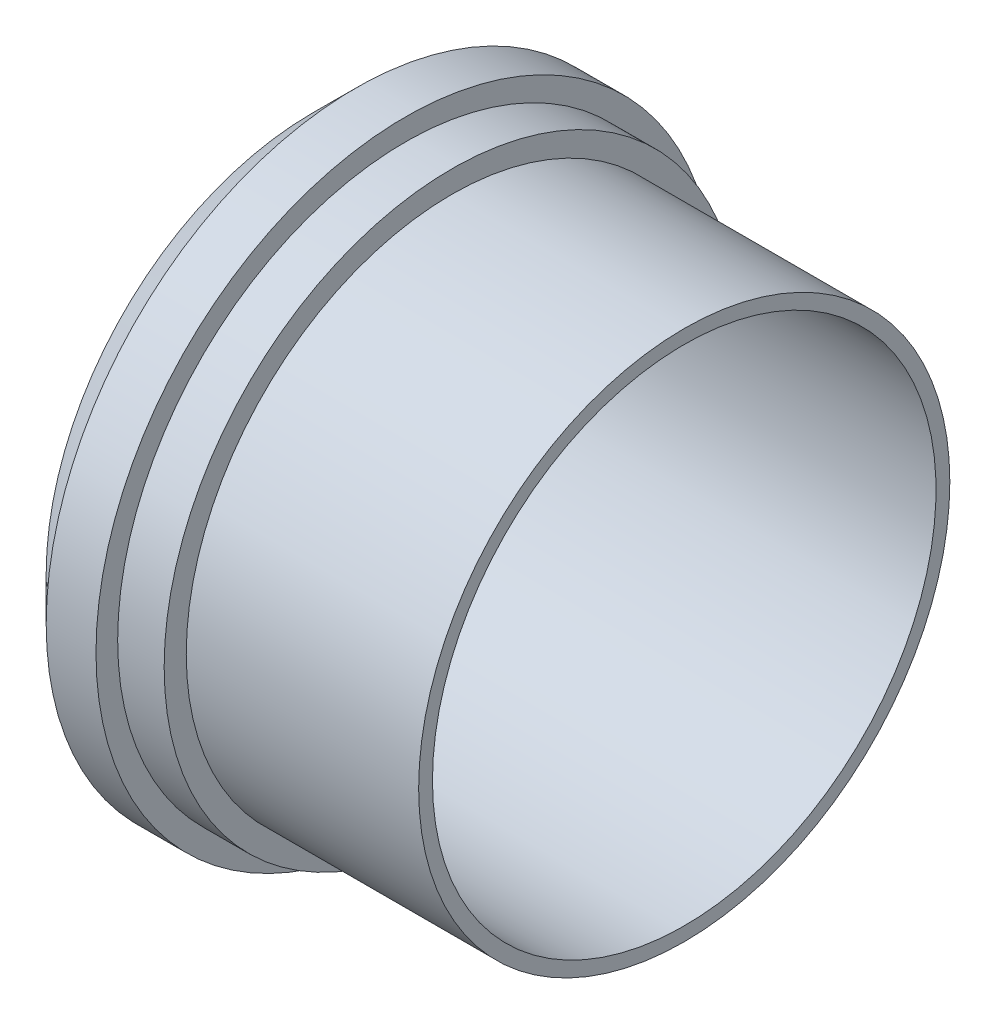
ISO-10303-21;
HEADER;
FILE_DESCRIPTION(('STEP AP214'),'2;1');
FILE_NAME('part.step','',(''),(''),'','','');
FILE_SCHEMA(('AUTOMOTIVE_DESIGN { 1 0 10303 214 1 1 1 1 }'));
ENDSEC;
DATA;
#1=APPLICATION_CONTEXT('core data for automotive mechanical design processes');
#2=APPLICATION_PROTOCOL_DEFINITION('international standard','automotive_design',2000,#1);
#3=PRODUCT_CONTEXT('',#1,'mechanical');
#4=PRODUCT('Part','Part','',(#3));
#5=PRODUCT_RELATED_PRODUCT_CATEGORY('part','',(#4));
#6=PRODUCT_DEFINITION_FORMATION('','',#4);
#7=PRODUCT_DEFINITION_CONTEXT('part definition',#1,'design');
#8=PRODUCT_DEFINITION('design','',#6,#7);
#9=PRODUCT_DEFINITION_SHAPE('','',#8);
#10=(LENGTH_UNIT() NAMED_UNIT(*) SI_UNIT(.MILLI.,.METRE.));
#11=(NAMED_UNIT(*) PLANE_ANGLE_UNIT() SI_UNIT($,.RADIAN.));
#12=(NAMED_UNIT(*) SI_UNIT($,.STERADIAN.) SOLID_ANGLE_UNIT());
#13=UNCERTAINTY_MEASURE_WITH_UNIT(LENGTH_MEASURE(1.E-05),#10,'distance_accuracy_value','');
#14=(GEOMETRIC_REPRESENTATION_CONTEXT(3) GLOBAL_UNCERTAINTY_ASSIGNED_CONTEXT((#13)) GLOBAL_UNIT_ASSIGNED_CONTEXT((#10,
#11,#12)) REPRESENTATION_CONTEXT('',''));
#15=CARTESIAN_POINT('',(0.,0.,0.));
#16=DIRECTION('',(0.,0.,1.));
#17=DIRECTION('',(1.,0.,0.));
#18=AXIS2_PLACEMENT_3D('',#15,#16,#17);
#19=CARTESIAN_POINT('',(0.,31.75,0.));
#20=DIRECTION('',(1.,0.,0.));
#21=DIRECTION('',(0.,0.,-1.));
#22=AXIS2_PLACEMENT_3D('',#19,#20,#21);
#23=PLANE('',#22);
#24=CARTESIAN_POINT('',(0.,31.75,0.));
#25=DIRECTION('',(-1.,0.,0.));
#26=DIRECTION('',(0.,0.,1.));
#27=AXIS2_PLACEMENT_3D('',#24,#25,#26);
#28=CIRCLE('',#27,30.099);
#29=CARTESIAN_POINT('',(0.,31.75,30.099));
#30=VERTEX_POINT('',#29);
#31=EDGE_CURVE('E59',#30,#30,#28,.T.);
#32=ORIENTED_EDGE('',*,*,#31,.T.);
#33=EDGE_LOOP('',(#32));
#34=FACE_BOUND('',#33,.T.);
#35=CARTESIAN_POINT('',(0.,31.75,0.));
#36=DIRECTION('',(-1.,0.,0.));
#37=DIRECTION('',(0.,0.,1.));
#38=AXIS2_PLACEMENT_3D('',#35,#36,#37);
#39=CIRCLE('',#38,31.75);
#40=CARTESIAN_POINT('',(0.,31.75,31.75));
#41=VERTEX_POINT('',#40);
#42=EDGE_CURVE('E10',#41,#41,#39,.T.);
#43=ORIENTED_EDGE('',*,*,#42,.F.);
#44=EDGE_LOOP('',(#43));
#45=FACE_BOUND('',#44,.T.);
#46=ADVANCED_FACE('F31',(#34,#45),#23,.T.);
#47=CARTESIAN_POINT('',(-44.45,31.75,0.));
#48=DIRECTION('',(-1.,0.,0.));
#49=DIRECTION('',(0.,0.,1.));
#50=AXIS2_PLACEMENT_3D('',#47,#48,#49);
#51=CYLINDRICAL_SURFACE('',#50,31.75);
#52=ORIENTED_EDGE('',*,*,#42,.T.);
#53=EDGE_LOOP('',(#52));
#54=FACE_BOUND('',#53,.T.);
#55=CARTESIAN_POINT('',(-27.77998,31.75,0.));
#56=DIRECTION('',(-1.,0.,0.));
#57=DIRECTION('',(0.,0.,1.));
#58=AXIS2_PLACEMENT_3D('',#55,#56,#57);
#59=CIRCLE('',#58,31.75);
#60=CARTESIAN_POINT('',(-27.77998,31.75,31.75));
#61=VERTEX_POINT('',#60);
#62=EDGE_CURVE('E37',#61,#61,#59,.T.);
#63=ORIENTED_EDGE('',*,*,#62,.F.);
#64=EDGE_LOOP('',(#63));
#65=FACE_BOUND('',#64,.T.);
#66=ADVANCED_FACE('F92',(#54,#65),#51,.T.);
#67=CARTESIAN_POINT('',(-27.77998,0.,0.));
#68=DIRECTION('',(1.,0.,0.));
#69=DIRECTION('',(0.,0.,-1.));
#70=AXIS2_PLACEMENT_3D('',#67,#68,#69);
#71=PLANE('',#70);
#72=ORIENTED_EDGE('',*,*,#62,.T.);
#73=EDGE_LOOP('',(#72));
#74=FACE_BOUND('',#73,.T.);
#75=CARTESIAN_POINT('',(-27.77998,31.75,0.));
#76=DIRECTION('',(-1.,0.,0.));
#77=DIRECTION('',(0.,0.,1.));
#78=AXIS2_PLACEMENT_3D('',#75,#76,#77);
#79=CIRCLE('',#78,34.3916);
#80=CARTESIAN_POINT('',(-27.77998,31.75,34.3916));
#81=VERTEX_POINT('',#80);
#82=EDGE_CURVE('E41',#81,#81,#79,.T.);
#83=ORIENTED_EDGE('',*,*,#82,.F.);
#84=EDGE_LOOP('',(#83));
#85=FACE_BOUND('',#84,.T.);
#86=ADVANCED_FACE('F96',(#74,#85),#71,.T.);
#87=CARTESIAN_POINT('',(-44.45,31.75,0.));
#88=DIRECTION('',(-1.,0.,0.));
#89=DIRECTION('',(0.,0.,1.));
#90=AXIS2_PLACEMENT_3D('',#87,#88,#89);
#91=CYLINDRICAL_SURFACE('',#90,34.3916);
#92=ORIENTED_EDGE('',*,*,#82,.T.);
#93=EDGE_LOOP('',(#92));
#94=FACE_BOUND('',#93,.T.);
#95=CARTESIAN_POINT('',(-33.3375,31.75,0.));
#96=DIRECTION('',(-1.,0.,0.));
#97=DIRECTION('',(0.,0.,1.));
#98=AXIS2_PLACEMENT_3D('',#95,#96,#97);
#99=CIRCLE('',#98,34.3916);
#100=CARTESIAN_POINT('',(-33.3375,31.75,34.3916));
#101=VERTEX_POINT('',#100);
#102=EDGE_CURVE('E45',#101,#101,#99,.T.);
#103=ORIENTED_EDGE('',*,*,#102,.F.);
#104=EDGE_LOOP('',(#103));
#105=FACE_BOUND('',#104,.T.);
#106=ADVANCED_FACE('F100',(#94,#105),#91,.T.);
#107=CARTESIAN_POINT('',(-33.3375,-2.64160000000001,0.));
#108=DIRECTION('',(1.,0.,0.));
#109=DIRECTION('',(0.,0.,-1.));
#110=AXIS2_PLACEMENT_3D('',#107,#108,#109);
#111=PLANE('',#110);
#112=ORIENTED_EDGE('',*,*,#102,.T.);
#113=EDGE_LOOP('',(#112));
#114=FACE_BOUND('',#113,.T.);
#115=CARTESIAN_POINT('',(-33.3375,31.75,0.));
#116=DIRECTION('',(-1.,0.,0.));
#117=DIRECTION('',(0.,0.,1.));
#118=AXIS2_PLACEMENT_3D('',#115,#116,#117);
#119=CIRCLE('',#118,36.9824);
#120=CARTESIAN_POINT('',(-33.3375,31.75,36.9824));
#121=VERTEX_POINT('',#120);
#122=EDGE_CURVE('E50',#121,#121,#119,.T.);
#123=ORIENTED_EDGE('',*,*,#122,.F.);
#124=EDGE_LOOP('',(#123));
#125=FACE_BOUND('',#124,.T.);
#126=ADVANCED_FACE('F88',(#114,#125),#111,.T.);
#127=CARTESIAN_POINT('',(-44.45,31.75,0.));
#128=DIRECTION('',(-1.,0.,0.));
#129=DIRECTION('',(0.,0.,1.));
#130=AXIS2_PLACEMENT_3D('',#127,#128,#129);
#131=CYLINDRICAL_SURFACE('',#130,36.9824);
#132=ORIENTED_EDGE('',*,*,#122,.T.);
#133=EDGE_LOOP('',(#132));
#134=FACE_BOUND('',#133,.T.);
#135=CARTESIAN_POINT('',(-39.29126,31.75,0.));
#136=DIRECTION('',(-1.,0.,0.));
#137=DIRECTION('',(0.,0.,1.));
#138=AXIS2_PLACEMENT_3D('',#135,#136,#137);
#139=CIRCLE('',#138,36.9824);
#140=CARTESIAN_POINT('',(-39.29126,31.75,36.9824));
#141=VERTEX_POINT('',#140);
#142=EDGE_CURVE('E53',#141,#141,#139,.T.);
#143=ORIENTED_EDGE('',*,*,#142,.F.);
#144=EDGE_LOOP('',(#143));
#145=FACE_BOUND('',#144,.T.);
#146=ADVANCED_FACE('F82',(#134,#145),#131,.T.);
#147=CARTESIAN_POINT('',(-44.45,31.75,0.));
#148=DIRECTION('',(1.,0.,0.));
#149=DIRECTION('',(0.,0.,-1.));
#150=AXIS2_PLACEMENT_3D('',#147,#148,#149);
#151=CONICAL_SURFACE('',#150,31.8262,0.785151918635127);
#152=ORIENTED_EDGE('',*,*,#142,.T.);
#153=EDGE_LOOP('',(#152));
#154=FACE_BOUND('',#153,.T.);
#155=CARTESIAN_POINT('',(-44.45,31.75,0.));
#156=DIRECTION('',(-1.,0.,0.));
#157=DIRECTION('',(0.,0.,1.));
#158=AXIS2_PLACEMENT_3D('',#155,#156,#157);
#159=CIRCLE('',#158,31.8262);
#160=CARTESIAN_POINT('',(-44.45,31.75,31.8262));
#161=VERTEX_POINT('',#160);
#162=EDGE_CURVE('E56',#161,#161,#159,.T.);
#163=ORIENTED_EDGE('',*,*,#162,.F.);
#164=EDGE_LOOP('',(#163));
#165=FACE_BOUND('',#164,.T.);
#166=ADVANCED_FACE('F77',(#154,#165),#151,.T.);
#167=CARTESIAN_POINT('',(-44.45,-0.0761999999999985,0.));
#168=DIRECTION('',(-1.,0.,0.));
#169=DIRECTION('',(0.,0.,1.));
#170=AXIS2_PLACEMENT_3D('',#167,#168,#169);
#171=PLANE('',#170);
#172=CARTESIAN_POINT('',(-44.45,31.75,0.));
#173=DIRECTION('',(-1.,0.,0.));
#174=DIRECTION('',(0.,0.,1.));
#175=AXIS2_PLACEMENT_3D('',#172,#173,#174);
#176=CIRCLE('',#175,30.099);
#177=CARTESIAN_POINT('',(-44.45,31.75,30.099));
#178=VERTEX_POINT('',#177);
#179=EDGE_CURVE('E60',#178,#178,#176,.T.);
#180=ORIENTED_EDGE('',*,*,#179,.F.);
#181=EDGE_LOOP('',(#180));
#182=FACE_BOUND('',#181,.T.);
#183=ORIENTED_EDGE('',*,*,#162,.T.);
#184=EDGE_LOOP('',(#183));
#185=FACE_BOUND('',#184,.T.);
#186=ADVANCED_FACE('F71',(#182,#185),#171,.T.);
#187=CARTESIAN_POINT('',(0.,31.75,0.));
#188=DIRECTION('',(-1.,0.,0.));
#189=DIRECTION('',(0.,0.,1.));
#190=AXIS2_PLACEMENT_3D('',#187,#188,#189);
#191=CYLINDRICAL_SURFACE('',#190,30.099);
#192=ORIENTED_EDGE('',*,*,#31,.F.);
#193=EDGE_LOOP('',(#192));
#194=FACE_BOUND('',#193,.T.);
#195=ORIENTED_EDGE('',*,*,#179,.T.);
#196=EDGE_LOOP('',(#195));
#197=FACE_BOUND('',#196,.T.);
#198=ADVANCED_FACE('F68',(#194,#197),#191,.F.);
#199=CLOSED_SHELL('',(#46,#66,#86,#106,#126,#146,#166,#186,#198));
#200=MANIFOLD_SOLID_BREP('B2',#199);
#201=ADVANCED_BREP_SHAPE_REPRESENTATION('',(#18,#200),#14);
#202=SHAPE_DEFINITION_REPRESENTATION(#9,#201);
ENDSEC;
END-ISO-10303-21;
